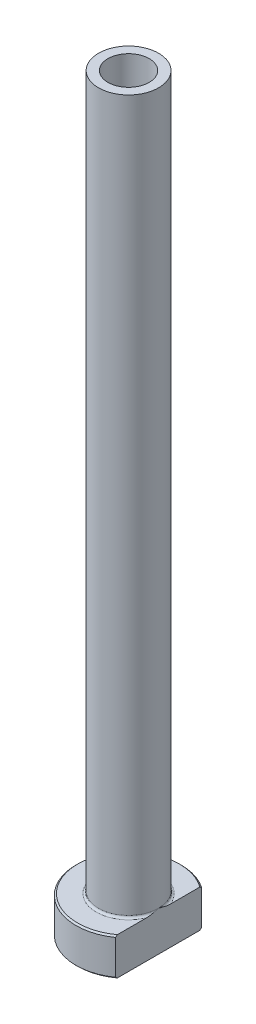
ISO-10303-21;
HEADER;
FILE_DESCRIPTION(('STEP AP214'),'2;1');
FILE_NAME('part.step','',(''),(''),'','','');
FILE_SCHEMA(('AUTOMOTIVE_DESIGN { 1 0 10303 214 1 1 1 1 }'));
ENDSEC;
DATA;
#1=APPLICATION_CONTEXT('core data for automotive mechanical design processes');
#2=APPLICATION_PROTOCOL_DEFINITION('international standard','automotive_design',2000,#1);
#3=PRODUCT_CONTEXT('',#1,'mechanical');
#4=PRODUCT('Part','Part','',(#3));
#5=PRODUCT_RELATED_PRODUCT_CATEGORY('part','',(#4));
#6=PRODUCT_DEFINITION_FORMATION('','',#4);
#7=PRODUCT_DEFINITION_CONTEXT('part definition',#1,'design');
#8=PRODUCT_DEFINITION('design','',#6,#7);
#9=PRODUCT_DEFINITION_SHAPE('','',#8);
#10=(LENGTH_UNIT() NAMED_UNIT(*) SI_UNIT(.MILLI.,.METRE.));
#11=(NAMED_UNIT(*) PLANE_ANGLE_UNIT() SI_UNIT($,.RADIAN.));
#12=(NAMED_UNIT(*) SI_UNIT($,.STERADIAN.) SOLID_ANGLE_UNIT());
#13=UNCERTAINTY_MEASURE_WITH_UNIT(LENGTH_MEASURE(1.E-05),#10,'distance_accuracy_value','');
#14=(GEOMETRIC_REPRESENTATION_CONTEXT(3) GLOBAL_UNCERTAINTY_ASSIGNED_CONTEXT((#13)) GLOBAL_UNIT_ASSIGNED_CONTEXT((#10,
#11,#12)) REPRESENTATION_CONTEXT('',''));
#15=CARTESIAN_POINT('',(0.,0.,0.));
#16=DIRECTION('',(0.,0.,1.));
#17=DIRECTION('',(1.,0.,0.));
#18=AXIS2_PLACEMENT_3D('',#15,#16,#17);
#19=CARTESIAN_POINT('',(0.,92.1876809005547,0.));
#20=DIRECTION('',(0.,1.,0.));
#21=DIRECTION('',(0.,0.,1.));
#22=AXIS2_PLACEMENT_3D('',#19,#20,#21);
#23=CYLINDRICAL_SURFACE('',#22,2.74999999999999);
#24=CARTESIAN_POINT('',(0.,100.,0.));
#25=DIRECTION('',(0.,1.,0.));
#26=DIRECTION('',(0.,0.,1.));
#27=AXIS2_PLACEMENT_3D('',#24,#25,#26);
#28=CIRCLE('',#27,2.74999999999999);
#29=CARTESIAN_POINT('',(0.,100.,2.74999999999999));
#30=VERTEX_POINT('',#29);
#31=EDGE_CURVE('E167',#30,#30,#28,.T.);
#32=ORIENTED_EDGE('',*,*,#31,.T.);
#33=EDGE_LOOP('',(#32));
#34=FACE_BOUND('',#33,.T.);
#35=CARTESIAN_POINT('',(0.,55.,0.));
#36=DIRECTION('',(0.,1.,0.));
#37=DIRECTION('',(0.,0.,1.));
#38=AXIS2_PLACEMENT_3D('',#35,#36,#37);
#39=CIRCLE('',#38,2.74999999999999);
#40=CARTESIAN_POINT('',(0.,55.,2.74999999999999));
#41=VERTEX_POINT('',#40);
#42=EDGE_CURVE('E170',#41,#41,#39,.T.);
#43=ORIENTED_EDGE('',*,*,#42,.F.);
#44=EDGE_LOOP('',(#43));
#45=FACE_BOUND('',#44,.T.);
#46=ADVANCED_FACE('F32',(#34,#45),#23,.F.);
#47=CARTESIAN_POINT('',(-2.74999999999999,100.,0.));
#48=DIRECTION('',(0.,1.,0.));
#49=DIRECTION('',(0.,0.,1.));
#50=AXIS2_PLACEMENT_3D('',#47,#48,#49);
#51=PLANE('',#50);
#52=CARTESIAN_POINT('',(0.,100.,0.));
#53=DIRECTION('',(0.,1.,0.));
#54=DIRECTION('',(0.,0.,1.));
#55=AXIS2_PLACEMENT_3D('',#52,#53,#54);
#56=CIRCLE('',#55,4.);
#57=CARTESIAN_POINT('',(0.,100.,4.));
#58=VERTEX_POINT('',#57);
#59=EDGE_CURVE('E174',#58,#58,#56,.T.);
#60=ORIENTED_EDGE('',*,*,#59,.T.);
#61=EDGE_LOOP('',(#60));
#62=FACE_BOUND('',#61,.T.);
#63=ORIENTED_EDGE('',*,*,#31,.F.);
#64=EDGE_LOOP('',(#63));
#65=FACE_BOUND('',#64,.T.);
#66=ADVANCED_FACE('F157',(#62,#65),#51,.T.);
#67=CARTESIAN_POINT('',(0.,92.1876809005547,0.));
#68=DIRECTION('',(0.,1.,0.));
#69=DIRECTION('',(0.,0.,1.));
#70=AXIS2_PLACEMENT_3D('',#67,#68,#69);
#71=CYLINDRICAL_SURFACE('',#70,4.);
#72=CARTESIAN_POINT('',(0.,5.3,0.));
#73=DIRECTION('',(0.,1.,0.));
#74=DIRECTION('',(0.,0.,1.));
#75=AXIS2_PLACEMENT_3D('',#72,#73,#74);
#76=CIRCLE('',#75,4.);
#77=CARTESIAN_POINT('',(4.,5.3,0.));
#78=VERTEX_POINT('',#77);
#79=EDGE_CURVE('E180',#78,#78,#76,.T.);
#80=ORIENTED_EDGE('',*,*,#79,.T.);
#81=EDGE_LOOP('',(#80));
#82=FACE_BOUND('',#81,.T.);
#83=ORIENTED_EDGE('',*,*,#59,.F.);
#84=EDGE_LOOP('',(#83));
#85=FACE_BOUND('',#84,.T.);
#86=ADVANCED_FACE('F162',(#82,#85),#71,.T.);
#87=CARTESIAN_POINT('',(-3.99999999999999,5.,0.));
#88=DIRECTION('',(0.,1.,0.));
#89=DIRECTION('',(0.,0.,1.));
#90=AXIS2_PLACEMENT_3D('',#87,#88,#89);
#91=PLANE('',#90);
#92=DIRECTION('',(0.,0.,1.));
#93=VECTOR('',#92,1.);
#94=CARTESIAN_POINT('',(4.,5.,0.));
#95=LINE('',#94,#93);
#96=CARTESIAN_POINT('',(4.,5.,-5.499090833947));
#97=VERTEX_POINT('',#96);
#98=CARTESIAN_POINT('',(4.,5.,-1.57797338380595));
#99=VERTEX_POINT('',#98);
#100=EDGE_CURVE('E54',#97,#99,#95,.T.);
#101=ORIENTED_EDGE('',*,*,#100,.F.);
#102=CARTESIAN_POINT('',(0.,5.,0.));
#103=DIRECTION('',(0.,1.,0.));
#104=DIRECTION('',(0.,0.,1.));
#105=AXIS2_PLACEMENT_3D('',#102,#103,#104);
#106=CIRCLE('',#105,6.79999999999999);
#107=CARTESIAN_POINT('',(3.99999999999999,5.,5.499090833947));
#108=VERTEX_POINT('',#107);
#109=EDGE_CURVE('E186',#97,#108,#106,.T.);
#110=ORIENTED_EDGE('',*,*,#109,.T.);
#111=CARTESIAN_POINT('',(4.,5.,1.57797338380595));
#112=VERTEX_POINT('',#111);
#113=EDGE_CURVE('E134',#112,#108,#95,.T.);
#114=ORIENTED_EDGE('',*,*,#113,.F.);
#115=CARTESIAN_POINT('',(0.,5.,0.));
#116=DIRECTION('',(0.,1.,0.));
#117=DIRECTION('',(0.,0.,1.));
#118=AXIS2_PLACEMENT_3D('',#115,#116,#117);
#119=CIRCLE('',#118,4.3);
#120=EDGE_CURVE('E183',#112,#99,#119,.F.);
#121=ORIENTED_EDGE('',*,*,#120,.T.);
#122=EDGE_LOOP('',(#101,#110,#114,#121));
#123=FACE_BOUND('',#122,.T.);
#124=ADVANCED_FACE('F197',(#123),#91,.T.);
#125=CARTESIAN_POINT('',(0.,92.1876809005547,0.));
#126=DIRECTION('',(0.,1.,0.));
#127=DIRECTION('',(0.,0.,1.));
#128=AXIS2_PLACEMENT_3D('',#125,#126,#127);
#129=CYLINDRICAL_SURFACE('',#128,6.99999999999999);
#130=DIRECTION('',(0.,-1.,0.));
#131=VECTOR('',#130,1.);
#132=CARTESIAN_POINT('',(3.99999999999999,100.,5.74456264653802));
#133=LINE('',#132,#131);
#134=CARTESIAN_POINT('',(3.99999999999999,4.8,5.74456264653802));
#135=VERTEX_POINT('',#134);
#136=CARTESIAN_POINT('',(3.99999999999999,0.199999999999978,5.74456264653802));
#137=VERTEX_POINT('',#136);
#138=EDGE_CURVE('E82',#135,#137,#133,.T.);
#139=ORIENTED_EDGE('',*,*,#138,.F.);
#140=CARTESIAN_POINT('',(0.,4.8,0.));
#141=DIRECTION('',(0.,1.,0.));
#142=DIRECTION('',(0.,0.,1.));
#143=AXIS2_PLACEMENT_3D('',#140,#141,#142);
#144=CIRCLE('',#143,6.99999999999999);
#145=CARTESIAN_POINT('',(4.,4.8,-5.74456264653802));
#146=VERTEX_POINT('',#145);
#147=EDGE_CURVE('E95',#135,#146,#144,.F.);
#148=ORIENTED_EDGE('',*,*,#147,.T.);
#149=DIRECTION('',(0.,-1.,0.));
#150=VECTOR('',#149,1.);
#151=CARTESIAN_POINT('',(4.,100.,-5.74456264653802));
#152=LINE('',#151,#150);
#153=CARTESIAN_POINT('',(4.,0.199999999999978,-5.74456264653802));
#154=VERTEX_POINT('',#153);
#155=EDGE_CURVE('E192',#146,#154,#152,.T.);
#156=ORIENTED_EDGE('',*,*,#155,.T.);
#157=CARTESIAN_POINT('',(0.,0.199999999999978,0.));
#158=DIRECTION('',(0.,-1.,0.));
#159=DIRECTION('',(0.,0.,-1.));
#160=AXIS2_PLACEMENT_3D('',#157,#158,#159);
#161=CIRCLE('',#160,6.99999999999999);
#162=EDGE_CURVE('E98',#154,#137,#161,.F.);
#163=ORIENTED_EDGE('',*,*,#162,.T.);
#164=EDGE_LOOP('',(#139,#148,#156,#163));
#165=FACE_BOUND('',#164,.T.);
#166=ADVANCED_FACE('F190',(#165),#129,.T.);
#167=CARTESIAN_POINT('',(-6.99999999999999,0.,0.));
#168=DIRECTION('',(0.,-1.,0.));
#169=DIRECTION('',(0.,0.,-1.));
#170=AXIS2_PLACEMENT_3D('',#167,#168,#169);
#171=PLANE('',#170);
#172=CARTESIAN_POINT('',(0.,0.,0.));
#173=DIRECTION('',(0.,-1.,0.));
#174=DIRECTION('',(0.,0.,-1.));
#175=AXIS2_PLACEMENT_3D('',#172,#173,#174);
#176=CIRCLE('',#175,3.49999999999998);
#177=CARTESIAN_POINT('',(0.,0.,-3.49999999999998));
#178=VERTEX_POINT('',#177);
#179=EDGE_CURVE('E40',#178,#178,#176,.F.);
#180=ORIENTED_EDGE('',*,*,#179,.T.);
#181=EDGE_LOOP('',(#180));
#182=FACE_BOUND('',#181,.T.);
#183=DIRECTION('',(0.,0.,-1.));
#184=VECTOR('',#183,1.);
#185=CARTESIAN_POINT('',(3.99999999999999,0.,5.74456264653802));
#186=LINE('',#185,#184);
#187=CARTESIAN_POINT('',(3.99999999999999,0.,5.49909083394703));
#188=VERTEX_POINT('',#187);
#189=CARTESIAN_POINT('',(4.,0.,-5.49909083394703));
#190=VERTEX_POINT('',#189);
#191=EDGE_CURVE('E47',#188,#190,#186,.T.);
#192=ORIENTED_EDGE('',*,*,#191,.F.);
#193=CARTESIAN_POINT('',(0.,0.,0.));
#194=DIRECTION('',(0.,-1.,0.));
#195=DIRECTION('',(0.,0.,-1.));
#196=AXIS2_PLACEMENT_3D('',#193,#194,#195);
#197=CIRCLE('',#196,6.80000000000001);
#198=EDGE_CURVE('E92',#188,#190,#197,.T.);
#199=ORIENTED_EDGE('',*,*,#198,.T.);
#200=EDGE_LOOP('',(#192,#199));
#201=FACE_BOUND('',#200,.T.);
#202=ADVANCED_FACE('F91',(#182,#201),#171,.T.);
#203=CARTESIAN_POINT('',(0.,92.1876809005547,0.));
#204=DIRECTION('',(0.,1.,0.));
#205=DIRECTION('',(0.,0.,1.));
#206=AXIS2_PLACEMENT_3D('',#203,#204,#205);
#207=CYLINDRICAL_SURFACE('',#206,2.99999999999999);
#208=CARTESIAN_POINT('',(0.,0.499999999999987,0.));
#209=DIRECTION('',(0.,-1.,0.));
#210=DIRECTION('',(0.,0.,-1.));
#211=AXIS2_PLACEMENT_3D('',#208,#209,#210);
#212=CIRCLE('',#211,2.99999999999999);
#213=CARTESIAN_POINT('',(0.,0.499999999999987,-2.99999999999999));
#214=VERTEX_POINT('',#213);
#215=EDGE_CURVE('E11',#214,#214,#212,.T.);
#216=ORIENTED_EDGE('',*,*,#215,.T.);
#217=EDGE_LOOP('',(#216));
#218=FACE_BOUND('',#217,.T.);
#219=CARTESIAN_POINT('',(0.,43.,0.));
#220=DIRECTION('',(0.,1.,0.));
#221=DIRECTION('',(0.,0.,1.));
#222=AXIS2_PLACEMENT_3D('',#219,#220,#221);
#223=CIRCLE('',#222,3.);
#224=CARTESIAN_POINT('',(0.,43.,3.));
#225=VERTEX_POINT('',#224);
#226=EDGE_CURVE('E172',#225,#225,#223,.T.);
#227=ORIENTED_EDGE('',*,*,#226,.T.);
#228=EDGE_LOOP('',(#227));
#229=FACE_BOUND('',#228,.T.);
#230=ADVANCED_FACE('F215',(#218,#229),#207,.F.);
#231=CARTESIAN_POINT('',(0.,43.,0.));
#232=DIRECTION('',(0.,-1.,0.));
#233=DIRECTION('',(0.,0.,-1.));
#234=AXIS2_PLACEMENT_3D('',#231,#232,#233);
#235=CONICAL_SURFACE('',#234,3.,0.0208303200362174);
#236=ORIENTED_EDGE('',*,*,#42,.T.);
#237=EDGE_LOOP('',(#236));
#238=FACE_BOUND('',#237,.T.);
#239=ORIENTED_EDGE('',*,*,#226,.F.);
#240=EDGE_LOOP('',(#239));
#241=FACE_BOUND('',#240,.T.);
#242=ADVANCED_FACE('F111',(#238,#241),#235,.F.);
#243=CARTESIAN_POINT('',(0.,5.3,0.));
#244=DIRECTION('',(0.,1.,0.));
#245=DIRECTION('',(0.,0.,1.));
#246=AXIS2_PLACEMENT_3D('',#243,#244,#245);
#247=TOROIDAL_SURFACE('',#246,4.3,0.3);
#248=ORIENTED_EDGE('',*,*,#120,.F.);
#249=CARTESIAN_POINT('',(4.,5.3,0.));
#250=CARTESIAN_POINT('',(4.,5.30000062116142,-1.06250722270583E-10));
#251=CARTESIAN_POINT('',(4.,5.30000124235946,2.17726018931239E-07));
#252=CARTESIAN_POINT('',(4.,5.30000240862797,8.3614089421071E-07));
#253=CARTESIAN_POINT('',(4.,5.30000294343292,1.25011668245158E-06));
#254=CARTESIAN_POINT('',(4.,5.30000404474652,2.2395931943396E-06));
#255=CARTESIAN_POINT('',(4.,5.30000459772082,2.83084440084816E-06));
#256=CARTESIAN_POINT('',(4.,5.30000559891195,4.06516578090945E-06));
#257=CARTESIAN_POINT('',(4.,5.30000604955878,4.70640059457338E-06));
#258=CARTESIAN_POINT('',(4.,5.30000769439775,7.15677166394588E-06));
#259=CARTESIAN_POINT('',(4.,5.30000879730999,9.02995921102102E-06));
#260=CARTESIAN_POINT('',(4.,5.30001063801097,1.27664881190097E-05));
#261=CARTESIAN_POINT('',(4.,5.30001139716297,1.46197801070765E-05));
#262=CARTESIAN_POINT('',(4.,5.30001453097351,2.23679212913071E-05));
#263=CARTESIAN_POINT('',(4.,5.30001683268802,2.82968736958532E-05));
#264=CARTESIAN_POINT('',(4.,5.30002027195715,3.95668715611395E-05));
#265=CARTESIAN_POINT('',(4.,5.30002152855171,4.48715448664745E-05));
#266=CARTESIAN_POINT('',(4.,5.30003060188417,8.40118178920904E-05));
#267=CARTESIAN_POINT('',(4.,5.30003739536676,0.000118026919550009));
#268=CARTESIAN_POINT('',(4.,5.30006713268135,0.000252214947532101));
#269=CARTESIAN_POINT('',(4.,5.30009559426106,0.000351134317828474));
#270=CARTESIAN_POINT('',(4.,5.3002062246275,0.00074247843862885));
#271=CARTESIAN_POINT('',(4.,5.30028475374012,0.00103561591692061));
#272=CARTESIAN_POINT('',(4.,5.30059889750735,0.0021992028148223));
#273=CARTESIAN_POINT('',(4.,5.30083905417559,0.00306873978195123));
#274=CARTESIAN_POINT('',(4.,5.3018368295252,0.00669141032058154));
#275=CARTESIAN_POINT('',(4.,5.30258877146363,0.00944568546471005));
#276=CARTESIAN_POINT('',(4.,5.31066890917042,0.039029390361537));
#277=CARTESIAN_POINT('',(4.,5.31802631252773,0.0658531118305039));
#278=CARTESIAN_POINT('',(4.,5.33239676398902,0.118441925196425));
#279=CARTESIAN_POINT('',(4.,5.33941183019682,0.144206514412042));
#280=CARTESIAN_POINT('',(4.,5.35427366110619,0.199017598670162));
#281=CARTESIAN_POINT('',(4.,5.36211313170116,0.228066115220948));
#282=CARTESIAN_POINT('',(4.,5.37776349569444,0.286511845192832));
#283=CARTESIAN_POINT('',(4.,5.38557313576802,0.31590939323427));
#284=CARTESIAN_POINT('',(4.,5.40425662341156,0.386994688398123));
#285=CARTESIAN_POINT('',(4.,5.41505237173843,0.428703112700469));
#286=CARTESIAN_POINT('',(4.,5.43592310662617,0.511098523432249));
#287=CARTESIAN_POINT('',(4.,5.44600969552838,0.551782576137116));
#288=CARTESIAN_POINT('',(4.,5.4785098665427,0.686599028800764));
#289=CARTESIAN_POINT('',(4.,5.4997837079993,0.781011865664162));
#290=CARTESIAN_POINT('',(4.,5.53807543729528,0.971847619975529));
#291=CARTESIAN_POINT('',(4.,5.55504273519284,1.06828120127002));
#292=CARTESIAN_POINT('',(4.,5.57582405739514,1.21752725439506));
#293=CARTESIAN_POINT('',(4.,5.58209796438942,1.26999379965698));
#294=CARTESIAN_POINT('',(4.,5.59210686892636,1.37516324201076));
#295=CARTESIAN_POINT('',(4.,5.59584265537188,1.42786606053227));
#296=CARTESIAN_POINT('',(4.,5.60010438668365,1.53310673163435));
#297=CARTESIAN_POINT('',(4.,5.6006487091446,1.5856437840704));
#298=CARTESIAN_POINT('',(4.,5.59767158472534,1.69058605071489));
#299=CARTESIAN_POINT('',(4.,5.59415502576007,1.74299134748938));
#300=CARTESIAN_POINT('',(4.,5.58503062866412,1.81903290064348));
#301=CARTESIAN_POINT('',(4.,5.58157617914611,1.84292934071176));
#302=CARTESIAN_POINT('',(4.,5.57329952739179,1.89051061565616));
#303=CARTESIAN_POINT('',(4.,5.56847619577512,1.91419525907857));
#304=CARTESIAN_POINT('',(4.,5.55726644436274,1.96092888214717));
#305=CARTESIAN_POINT('',(4.,5.55089740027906,1.98398195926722));
#306=CARTESIAN_POINT('',(4.,5.53623434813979,2.02945550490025));
#307=CARTESIAN_POINT('',(4.,5.52794253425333,2.05187666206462));
#308=CARTESIAN_POINT('',(4.,5.50887098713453,2.09590631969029));
#309=CARTESIAN_POINT('',(4.,5.49806837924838,2.11750508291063));
#310=CARTESIAN_POINT('',(4.,5.47333401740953,2.15885583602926));
#311=CARTESIAN_POINT('',(4.,5.45941272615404,2.17861369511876));
#312=CARTESIAN_POINT('',(4.,5.43588221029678,2.20522942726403));
#313=CARTESIAN_POINT('',(4.,5.42781139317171,2.2134404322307));
#314=CARTESIAN_POINT('',(4.,5.41065114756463,2.2287514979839));
#315=CARTESIAN_POINT('',(4.,5.40156129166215,2.23585108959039));
#316=CARTESIAN_POINT('',(4.,5.38220524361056,2.2485969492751));
#317=CARTESIAN_POINT('',(4.,5.37192420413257,2.25422119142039));
#318=CARTESIAN_POINT('',(4.,5.35045072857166,2.2633106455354));
#319=CARTESIAN_POINT('',(4.,5.33926122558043,2.26678251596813));
#320=CARTESIAN_POINT('',(4.,5.31952044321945,2.27051268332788));
#321=CARTESIAN_POINT('',(4.,5.3110845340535,2.27139016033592));
#322=CARTESIAN_POINT('',(4.,5.29418624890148,2.2716896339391));
#323=CARTESIAN_POINT('',(4.,5.28572387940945,2.27111196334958));
#324=CARTESIAN_POINT('',(4.,5.26904138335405,2.26855580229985));
#325=CARTESIAN_POINT('',(4.,5.26082066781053,2.26658107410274));
#326=CARTESIAN_POINT('',(4.,5.24478214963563,2.26139496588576));
#327=CARTESIAN_POINT('',(4.,5.23696461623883,2.25818277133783));
#328=CARTESIAN_POINT('',(4.,5.21851235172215,2.24908332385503));
#329=CARTESIAN_POINT('',(4.,5.20815219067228,2.24264095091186));
#330=CARTESIAN_POINT('',(4.,5.18857975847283,2.22819957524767));
#331=CARTESIAN_POINT('',(4.,5.17937061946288,2.2201964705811));
#332=CARTESIAN_POINT('',(4.,5.15665383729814,2.19777756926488));
#333=CARTESIAN_POINT('',(4.,5.14403484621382,2.18246908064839));
#334=CARTESIAN_POINT('',(4.,5.12118369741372,2.15020843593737));
#335=CARTESIAN_POINT('',(4.,5.11095480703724,2.13325407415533));
#336=CARTESIAN_POINT('',(4.,5.09273574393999,2.09892324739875));
#337=CARTESIAN_POINT('',(4.,5.08468212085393,2.08157988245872));
#338=CARTESIAN_POINT('',(4.,5.07005901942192,2.04627072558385));
#339=CARTESIAN_POINT('',(4.,5.06349101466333,2.02830433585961));
#340=CARTESIAN_POINT('',(4.,5.04555485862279,1.97350761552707));
#341=CARTESIAN_POINT('',(4.,5.03608974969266,1.93605770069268));
#342=CARTESIAN_POINT('',(4.,5.01780569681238,1.84529235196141));
#343=CARTESIAN_POINT('',(4.,5.01077018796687,1.79164082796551));
#344=CARTESIAN_POINT('',(4.,5.00182846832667,1.68379947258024));
#345=CARTESIAN_POINT('',(4.,4.99993887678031,1.62960846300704));
#346=CARTESIAN_POINT('',(4.,5.00006129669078,1.52361204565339));
#347=CARTESIAN_POINT('',(4.,5.0019069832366,1.47180551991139));
#348=CARTESIAN_POINT('',(4.,5.0084124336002,1.36835357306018));
#349=CARTESIAN_POINT('',(4.,5.01307376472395,1.31670825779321));
#350=CARTESIAN_POINT('',(4.,5.02905484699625,1.17431887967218));
#351=CARTESIAN_POINT('',(4.,5.04274090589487,1.08384207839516));
#352=CARTESIAN_POINT('',(4.,5.06701714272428,0.947757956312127));
#353=CARTESIAN_POINT('',(4.,5.07585573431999,0.901814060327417));
#354=CARTESIAN_POINT('',(4.,5.09458665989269,0.810008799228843));
#355=CARTESIAN_POINT('',(4.,5.1044818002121,0.764148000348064));
#356=CARTESIAN_POINT('',(4.,5.12892434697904,0.655631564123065));
#357=CARTESIAN_POINT('',(4.,5.14383556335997,0.593058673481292));
#358=CARTESIAN_POINT('',(4.,5.17458762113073,0.468885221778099));
#359=CARTESIAN_POINT('',(4.,5.19041623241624,0.407281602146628));
#360=CARTESIAN_POINT('',(4.,5.22090834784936,0.29123270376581));
#361=CARTESIAN_POINT('',(4.,5.23550024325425,0.236768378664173));
#362=CARTESIAN_POINT('',(4.,5.26562550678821,0.125604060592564));
#363=CARTESIAN_POINT('',(4.,5.28117250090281,0.0689076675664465));
#364=CARTESIAN_POINT('',(4.,5.29741226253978,0.0094415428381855));
#365=CARTESIAN_POINT('',(4.,5.29816540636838,0.00668315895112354));
#366=CARTESIAN_POINT('',(4.,5.29916346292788,0.00305954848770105));
#367=CARTESIAN_POINT('',(4.,5.29940273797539,0.00219318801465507));
#368=CARTESIAN_POINT('',(4.,5.2997158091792,0.00103357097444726));
#369=CARTESIAN_POINT('',(4.,5.29979412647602,0.00074122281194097));
#370=CARTESIAN_POINT('',(4.,5.29990450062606,0.000350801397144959));
#371=CARTESIAN_POINT('',(4.,5.29993292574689,0.000252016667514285));
#372=CARTESIAN_POINT('',(4.,5.29996263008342,0.000117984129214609));
#373=CARTESIAN_POINT('',(4.,5.29996941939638,8.39881862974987E-05));
#374=CARTESIAN_POINT('',(4.,5.29997848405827,4.48673992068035E-05));
#375=CARTESIAN_POINT('',(4.,5.29997973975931,3.95638164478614E-05));
#376=CARTESIAN_POINT('',(4.,5.29998317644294,2.8296031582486E-05));
#377=CARTESIAN_POINT('',(4.,5.2999854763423,2.23681438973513E-05));
#378=CARTESIAN_POINT('',(4.,5.29998860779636,1.46210990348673E-05));
#379=CARTESIAN_POINT('',(4.,5.29998936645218,1.27678887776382E-05));
#380=CARTESIAN_POINT('',(4.,5.29999120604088,9.03143944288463E-06));
#381=CARTESIAN_POINT('',(4.,5.29999230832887,7.15824000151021E-06));
#382=CARTESIAN_POINT('',(4.,5.29999395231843,4.70775467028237E-06));
#383=CARTESIAN_POINT('',(4.,5.29999440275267,4.06646329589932E-06));
#384=CARTESIAN_POINT('',(4.,5.29999540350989,2.83199042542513E-06));
#385=CARTESIAN_POINT('',(4.,5.29999595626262,2.24064306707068E-06));
#386=CARTESIAN_POINT('',(4.,5.29999705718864,1.25093947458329E-06));
#387=CARTESIAN_POINT('',(4.,5.2999975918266,8.36840866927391E-07));
#388=CARTESIAN_POINT('',(4.,5.29999875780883,2.18117657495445E-07));
#389=CARTESIAN_POINT('',(4.,5.29999937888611,1.06243800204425E-10));
#390=CARTESIAN_POINT('',(4.,5.3,0.));
#391=B_SPLINE_CURVE_WITH_KNOTS('',3,(#249,#250,#251,#252,#253,#254,#255,#256,#257,#258,#259,
#260,#261,#262,#263,#264,#265,#266,#267,#268,#269,#270,#271,#272,#273,#274,#275,#276,#277,#278,
#279,#280,#281,#282,#283,#284,#285,#286,#287,#288,#289,#290,#291,#292,#293,#294,#295,#296,#297,
#298,#299,#300,#301,#302,#303,#304,#305,#306,#307,#308,#309,#310,#311,#312,#313,#314,#315,#316,
#317,#318,#319,#320,#321,#322,#323,#324,#325,#326,#327,#328,#329,#330,#331,#332,#333,#334,#335,
#336,#337,#338,#339,#340,#341,#342,#343,#344,#345,#346,#347,#348,#349,#350,#351,#352,#353,#354,
#355,#356,#357,#358,#359,#360,#361,#362,#363,#364,#365,#366,#367,#368,#369,#370,#371,#372,#373,
#374,#375,#376,#377,#378,#379,#380,#381,#382,#383,#384,#385,#386,#387,#388,#389,#390),
.UNSPECIFIED.,.T.,.F.,(4,2,2,2,2,2,2,2,2,2,2,2,2,2,2,2,2,2,2,2,2,2,2,2,2,2,2,2,2,2,2,2,2,2,2,2,
2,2,2,2,2,2,2,2,2,2,2,2,2,2,2,2,2,2,2,2,2,2,2,2,2,2,2,2,2,2,2,2,2,2,4),(0.,1.87484528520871E-06,
3.90180232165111E-06,6.31684114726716E-06,8.6665232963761E-06,1.51627596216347E-05,
2.11657986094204E-05,4.02090827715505E-05,5.65429538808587E-05,0.00016062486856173,
0.000469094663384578,0.001379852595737,0.00408571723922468,0.0126514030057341,
0.0960918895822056,0.176200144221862,0.266463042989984,0.357714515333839,0.486961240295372,
0.612707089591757,0.902988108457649,1.19653589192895,1.35501075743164,1.51343634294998,
1.67094875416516,1.82827177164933,1.90067591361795,1.97313996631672,2.04482437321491,
2.11642737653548,2.18871023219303,2.26075412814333,2.29521947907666,2.32969934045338,
2.36466792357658,2.39952778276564,2.42485422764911,2.45017488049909,2.47542760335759,
2.50069697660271,2.53708899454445,2.57357798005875,2.63276032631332,2.6920231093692,
2.749303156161,2.80663977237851,2.92223125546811,3.08420752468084,3.24670629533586,
3.40212850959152,3.55763731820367,3.83192962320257,3.97228382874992,4.11302057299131,
4.30598130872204,4.49678885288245,4.66594443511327,4.84230602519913,4.85088453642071,
4.8535805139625,4.8544888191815,4.85479687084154,4.85490089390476,4.85491722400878,
4.85493626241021,4.85494226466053,4.85494875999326,4.85495110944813,4.85495352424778,
4.85495555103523,4.85495742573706),.UNSPECIFIED.);
#392=EDGE_CURVE('E126',#112,#78,#391,.T.);
#393=ORIENTED_EDGE('',*,*,#392,.T.);
#394=ORIENTED_EDGE('',*,*,#79,.F.);
#395=CARTESIAN_POINT('',(4.,5.3,0.));
#396=CARTESIAN_POINT('',(4.,5.29999937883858,1.06251755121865E-10));
#397=CARTESIAN_POINT('',(4.,5.29999875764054,-2.17726017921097E-07));
#398=CARTESIAN_POINT('',(4.,5.29999759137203,-8.36140893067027E-07));
#399=CARTESIAN_POINT('',(4.,5.29999705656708,-1.25011668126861E-06));
#400=CARTESIAN_POINT('',(4.,5.29999595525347,-2.23959319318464E-06));
#401=CARTESIAN_POINT('',(4.,5.29999540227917,-2.83084439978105E-06));
#402=CARTESIAN_POINT('',(4.,5.29999440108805,-4.06516577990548E-06));
#403=CARTESIAN_POINT('',(4.,5.29999395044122,-4.706400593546E-06));
#404=CARTESIAN_POINT('',(4.,5.29999230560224,-7.15677166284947E-06));
#405=CARTESIAN_POINT('',(3.99999999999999,5.29999120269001,-9.02995920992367E-06));
#406=CARTESIAN_POINT('',(3.99999999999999,5.29998936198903,-1.2766488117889E-05));
#407=CARTESIAN_POINT('',(4.,5.29998860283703,-1.46197801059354E-05));
#408=CARTESIAN_POINT('',(4.,5.29998546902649,-2.23679212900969E-05));
#409=CARTESIAN_POINT('',(4.,5.29998316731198,-2.82968736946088E-05));
#410=CARTESIAN_POINT('',(4.,5.29997972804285,-3.95668715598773E-05));
#411=CARTESIAN_POINT('',(4.,5.29997847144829,-4.48715448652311E-05));
#412=CARTESIAN_POINT('',(4.,5.29996939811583,-8.40118178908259E-05));
#413=CARTESIAN_POINT('',(4.,5.29996260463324,-0.000118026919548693));
#414=CARTESIAN_POINT('',(3.99999999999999,5.29993286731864,-0.000252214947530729));
#415=CARTESIAN_POINT('',(4.,5.29990440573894,-0.000351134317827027));
#416=CARTESIAN_POINT('',(4.,5.2997937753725,-0.000742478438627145));
#417=CARTESIAN_POINT('',(4.,5.29971524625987,-0.00103561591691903));
#418=CARTESIAN_POINT('',(3.99999999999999,5.29940110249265,-0.00219920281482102));
#419=CARTESIAN_POINT('',(3.99999999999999,5.29916094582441,-0.00306873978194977));
#420=CARTESIAN_POINT('',(4.,5.2981631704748,-0.00669141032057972));
#421=CARTESIAN_POINT('',(4.,5.29741122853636,-0.0094456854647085));
#422=CARTESIAN_POINT('',(3.99999999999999,5.28933109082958,-0.039029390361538));
#423=CARTESIAN_POINT('',(3.99999999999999,5.28197368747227,-0.0658531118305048));
#424=CARTESIAN_POINT('',(4.,5.26760323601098,-0.118441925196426));
#425=CARTESIAN_POINT('',(4.,5.26058816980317,-0.144206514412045));
#426=CARTESIAN_POINT('',(3.99999999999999,5.24572633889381,-0.199017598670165));
#427=CARTESIAN_POINT('',(4.,5.23788686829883,-0.22806611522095));
#428=CARTESIAN_POINT('',(4.,5.22223650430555,-0.286511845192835));
#429=CARTESIAN_POINT('',(4.,5.21442686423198,-0.315909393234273));
#430=CARTESIAN_POINT('',(4.,5.19574337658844,-0.386994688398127));
#431=CARTESIAN_POINT('',(4.,5.18494762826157,-0.428703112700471));
#432=CARTESIAN_POINT('',(4.,5.16407689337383,-0.511098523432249));
#433=CARTESIAN_POINT('',(4.,5.15399030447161,-0.551782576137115));
#434=CARTESIAN_POINT('',(4.,5.12149013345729,-0.686599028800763));
#435=CARTESIAN_POINT('',(4.,5.1002162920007,-0.781011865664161));
#436=CARTESIAN_POINT('',(4.,5.06192456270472,-0.971847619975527));
#437=CARTESIAN_POINT('',(4.,5.04495726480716,-1.06828120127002));
#438=CARTESIAN_POINT('',(4.,5.02417594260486,-1.21752725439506));
#439=CARTESIAN_POINT('',(4.,5.01790203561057,-1.26999379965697));
#440=CARTESIAN_POINT('',(4.,5.00789313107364,-1.37516324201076));
#441=CARTESIAN_POINT('',(4.,5.00415734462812,-1.42786606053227));
#442=CARTESIAN_POINT('',(4.,4.99989561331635,-1.53310673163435));
#443=CARTESIAN_POINT('',(4.,4.9993512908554,-1.5856437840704));
#444=CARTESIAN_POINT('',(4.,5.00232841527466,-1.69058605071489));
#445=CARTESIAN_POINT('',(4.,5.00584497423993,-1.74299134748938));
#446=CARTESIAN_POINT('',(4.,5.01496937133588,-1.81903290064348));
#447=CARTESIAN_POINT('',(4.,5.01842382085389,-1.84292934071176));
#448=CARTESIAN_POINT('',(4.,5.02670047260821,-1.89051061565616));
#449=CARTESIAN_POINT('',(4.,5.03152380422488,-1.91419525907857));
#450=CARTESIAN_POINT('',(4.,5.04273355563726,-1.96092888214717));
#451=CARTESIAN_POINT('',(4.,5.04910259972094,-1.98398195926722));
#452=CARTESIAN_POINT('',(4.,5.0637656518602,-2.02945550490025));
#453=CARTESIAN_POINT('',(4.,5.07205746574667,-2.05187666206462));
#454=CARTESIAN_POINT('',(4.,5.09112901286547,-2.09590631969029));
#455=CARTESIAN_POINT('',(4.,5.10193162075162,-2.11750508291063));
#456=CARTESIAN_POINT('',(4.,5.12666598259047,-2.15885583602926));
#457=CARTESIAN_POINT('',(4.,5.14058727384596,-2.17861369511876));
#458=CARTESIAN_POINT('',(4.,5.16411778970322,-2.20522942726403));
#459=CARTESIAN_POINT('',(4.,5.17218860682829,-2.2134404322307));
#460=CARTESIAN_POINT('',(4.,5.18934885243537,-2.2287514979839));
#461=CARTESIAN_POINT('',(4.,5.19843870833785,-2.23585108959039));
#462=CARTESIAN_POINT('',(4.,5.21779475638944,-2.2485969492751));
#463=CARTESIAN_POINT('',(4.,5.22807579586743,-2.25422119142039));
#464=CARTESIAN_POINT('',(4.,5.24954927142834,-2.2633106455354));
#465=CARTESIAN_POINT('',(4.,5.26073877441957,-2.26678251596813));
#466=CARTESIAN_POINT('',(4.,5.28047955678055,-2.27051268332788));
#467=CARTESIAN_POINT('',(4.,5.2889154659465,-2.27139016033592));
#468=CARTESIAN_POINT('',(4.,5.30581375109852,-2.2716896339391));
#469=CARTESIAN_POINT('',(4.,5.31427612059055,-2.27111196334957));
#470=CARTESIAN_POINT('',(4.,5.33095861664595,-2.26855580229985));
#471=CARTESIAN_POINT('',(4.,5.33917933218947,-2.26658107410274));
#472=CARTESIAN_POINT('',(4.,5.35521785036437,-2.26139496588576));
#473=CARTESIAN_POINT('',(4.,5.36303538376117,-2.25818277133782));
#474=CARTESIAN_POINT('',(4.,5.38148764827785,-2.24908332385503));
#475=CARTESIAN_POINT('',(4.,5.39184780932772,-2.24264095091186));
#476=CARTESIAN_POINT('',(4.,5.41142024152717,-2.22819957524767));
#477=CARTESIAN_POINT('',(4.,5.42062938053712,-2.2201964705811));
#478=CARTESIAN_POINT('',(4.,5.44334616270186,-2.19777756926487));
#479=CARTESIAN_POINT('',(4.,5.45596515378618,-2.18246908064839));
#480=CARTESIAN_POINT('',(4.,5.47881630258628,-2.15020843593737));
#481=CARTESIAN_POINT('',(4.,5.48904519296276,-2.13325407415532));
#482=CARTESIAN_POINT('',(4.,5.50726425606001,-2.09892324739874));
#483=CARTESIAN_POINT('',(4.,5.51531787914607,-2.08157988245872));
#484=CARTESIAN_POINT('',(4.,5.52994098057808,-2.04627072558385));
#485=CARTESIAN_POINT('',(4.,5.53650898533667,-2.02830433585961));
#486=CARTESIAN_POINT('',(4.,5.55444514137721,-1.97350761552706));
#487=CARTESIAN_POINT('',(4.,5.56391025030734,-1.93605770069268));
#488=CARTESIAN_POINT('',(4.,5.58219430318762,-1.8452923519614));
#489=CARTESIAN_POINT('',(4.,5.58922981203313,-1.79164082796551));
#490=CARTESIAN_POINT('',(4.,5.59817153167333,-1.68379947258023));
#491=CARTESIAN_POINT('',(4.,5.60006112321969,-1.62960846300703));
#492=CARTESIAN_POINT('',(4.,5.59993870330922,-1.52361204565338));
#493=CARTESIAN_POINT('',(4.,5.5980930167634,-1.47180551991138));
#494=CARTESIAN_POINT('',(4.,5.5915875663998,-1.36835357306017));
#495=CARTESIAN_POINT('',(4.,5.58692623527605,-1.31670825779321));
#496=CARTESIAN_POINT('',(4.,5.57094515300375,-1.17431887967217));
#497=CARTESIAN_POINT('',(4.,5.55725909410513,-1.08384207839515));
#498=CARTESIAN_POINT('',(4.,5.53298285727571,-0.947757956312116));
#499=CARTESIAN_POINT('',(4.,5.52414426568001,-0.901814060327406));
#500=CARTESIAN_POINT('',(4.,5.5054133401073,-0.810008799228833));
#501=CARTESIAN_POINT('',(4.,5.4955181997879,-0.764148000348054));
#502=CARTESIAN_POINT('',(4.,5.47107565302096,-0.655631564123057));
#503=CARTESIAN_POINT('',(4.,5.45616443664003,-0.593058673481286));
#504=CARTESIAN_POINT('',(4.,5.42541237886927,-0.468885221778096));
#505=CARTESIAN_POINT('',(3.99999999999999,5.40958376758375,-0.407281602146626));
#506=CARTESIAN_POINT('',(4.,5.37909165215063,-0.291232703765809));
#507=CARTESIAN_POINT('',(4.,5.36449975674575,-0.236768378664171));
#508=CARTESIAN_POINT('',(3.99999999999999,5.33437449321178,-0.125604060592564));
#509=CARTESIAN_POINT('',(3.99999999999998,5.31882749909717,-0.0689076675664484));
#510=CARTESIAN_POINT('',(4.,5.30258773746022,-0.00944154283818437));
#511=CARTESIAN_POINT('',(4.,5.30183459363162,-0.00668315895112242));
#512=CARTESIAN_POINT('',(3.99999999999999,5.30083653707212,-0.00305954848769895));
#513=CARTESIAN_POINT('',(3.99999999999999,5.30059726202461,-0.00219318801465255));
#514=CARTESIAN_POINT('',(4.,5.30028419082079,-0.00103357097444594));
#515=CARTESIAN_POINT('',(4.,5.30020587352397,-0.000741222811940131));
#516=CARTESIAN_POINT('',(4.,5.30009549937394,-0.000350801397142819));
#517=CARTESIAN_POINT('',(3.99999999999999,5.30006707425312,-0.000252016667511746));
#518=CARTESIAN_POINT('',(4.,5.30003736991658,-0.000117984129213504));
#519=CARTESIAN_POINT('',(4.,5.30003058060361,-8.39881862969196E-05));
#520=CARTESIAN_POINT('',(4.,5.30002151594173,-4.48673992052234E-05));
#521=CARTESIAN_POINT('',(4.,5.30002026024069,-3.95638164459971E-05));
#522=CARTESIAN_POINT('',(4.,5.30001682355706,-2.82960315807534E-05));
#523=CARTESIAN_POINT('',(4.,5.3000145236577,-2.23681438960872E-05));
#524=CARTESIAN_POINT('',(4.,5.30001139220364,-1.46210990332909E-05));
#525=CARTESIAN_POINT('',(3.99999999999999,5.30001063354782,-1.27678887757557E-05));
#526=CARTESIAN_POINT('',(3.99999999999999,5.30000879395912,-9.03143944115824E-06));
#527=CARTESIAN_POINT('',(4.,5.30000769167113,-7.15824000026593E-06));
#528=CARTESIAN_POINT('',(4.,5.30000604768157,-4.70775466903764E-06));
#529=CARTESIAN_POINT('',(4.,5.30000559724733,-4.0664632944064E-06));
#530=CARTESIAN_POINT('',(4.,5.30000459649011,-2.83199042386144E-06));
#531=CARTESIAN_POINT('',(4.,5.30000404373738,-2.24064306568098E-06));
#532=CARTESIAN_POINT('',(4.,5.30000294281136,-1.25093947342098E-06));
#533=CARTESIAN_POINT('',(4.,5.30000240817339,-8.36840865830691E-07));
#534=CARTESIAN_POINT('',(4.,5.30000124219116,-2.18117656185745E-07));
#535=CARTESIAN_POINT('',(4.,5.30000062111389,-1.06242417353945E-10));
#536=CARTESIAN_POINT('',(4.,5.3,0.));
#537=B_SPLINE_CURVE_WITH_KNOTS('',3,(#395,#396,#397,#398,#399,#400,#401,#402,#403,#404,#405,
#406,#407,#408,#409,#410,#411,#412,#413,#414,#415,#416,#417,#418,#419,#420,#421,#422,#423,#424,
#425,#426,#427,#428,#429,#430,#431,#432,#433,#434,#435,#436,#437,#438,#439,#440,#441,#442,#443,
#444,#445,#446,#447,#448,#449,#450,#451,#452,#453,#454,#455,#456,#457,#458,#459,#460,#461,#462,
#463,#464,#465,#466,#467,#468,#469,#470,#471,#472,#473,#474,#475,#476,#477,#478,#479,#480,#481,
#482,#483,#484,#485,#486,#487,#488,#489,#490,#491,#492,#493,#494,#495,#496,#497,#498,#499,#500,
#501,#502,#503,#504,#505,#506,#507,#508,#509,#510,#511,#512,#513,#514,#515,#516,#517,#518,#519,
#520,#521,#522,#523,#524,#525,#526,#527,#528,#529,#530,#531,#532,#533,#534,#535,#536),
.UNSPECIFIED.,.T.,.F.,(4,2,2,2,2,2,2,2,2,2,2,2,2,2,2,2,2,2,2,2,2,2,2,2,2,2,2,2,2,2,2,2,2,2,2,2,
2,2,2,2,2,2,2,2,2,2,2,2,2,2,2,2,2,2,2,2,2,2,2,2,2,2,2,2,2,2,2,2,2,2,4),(0.,1.87484528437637E-06,
3.90180232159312E-06,6.31684114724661E-06,8.66652329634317E-06,1.51627596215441E-05,
2.11657986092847E-05,4.02090827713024E-05,5.65429538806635E-05,0.000160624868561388,
0.000469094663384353,0.00137985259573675,0.00408571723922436,0.0126514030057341,
0.0960918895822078,0.176200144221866,0.266463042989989,0.357714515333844,0.486961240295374,
0.612707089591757,0.902988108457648,1.19653589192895,1.35501075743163,1.51343634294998,
1.67094875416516,1.82827177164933,1.90067591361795,1.97313996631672,2.04482437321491,
2.11642737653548,2.18871023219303,2.26075412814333,2.29521947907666,2.32969934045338,
2.36466792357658,2.39952778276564,2.42485422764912,2.45017488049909,2.47542760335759,
2.50069697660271,2.53708899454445,2.57357798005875,2.63276032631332,2.6920231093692,
2.74930315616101,2.80663977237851,2.92223125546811,3.08420752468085,3.24670629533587,
3.40212850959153,3.55763731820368,3.83192962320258,3.97228382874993,4.11302057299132,
4.30598130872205,4.49678885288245,4.66594443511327,4.84230602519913,4.85088453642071,
4.8535805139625,4.8544888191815,4.85479687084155,4.85490089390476,4.85491722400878,
4.85493626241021,4.85494226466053,4.85494875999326,4.85495110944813,4.85495352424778,
4.85495555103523,4.85495742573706),.UNSPECIFIED.);
#538=EDGE_CURVE('E135',#78,#99,#537,.T.);
#539=ORIENTED_EDGE('',*,*,#538,.T.);
#540=EDGE_LOOP('',(#248,#393,#394,#539));
#541=FACE_BOUND('',#540,.T.);
#542=ADVANCED_FACE('F141',(#541),#247,.F.);
#543=CARTESIAN_POINT('',(0.,5.,0.));
#544=DIRECTION('',(0.,-1.,0.));
#545=DIRECTION('',(0.,0.,-1.));
#546=AXIS2_PLACEMENT_3D('',#543,#544,#545);
#547=CONICAL_SURFACE('',#546,6.79999999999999,0.78539816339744);
#548=CARTESIAN_POINT('',(4.,-1.45712845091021,-12.6392822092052));
#549=CARTESIAN_POINT('',(4.,-1.24364466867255,-12.4153556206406));
#550=CARTESIAN_POINT('',(4.,-1.03042430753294,-12.1911774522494));
#551=CARTESIAN_POINT('',(4.,-0.604617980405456,-11.7422167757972));
#552=CARTESIAN_POINT('',(4.,-0.392032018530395,-11.5174342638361));
#553=CARTESIAN_POINT('',(4.,0.0324624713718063,-11.0670952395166));
#554=CARTESIAN_POINT('',(4.,0.244370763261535,-10.8415385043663));
#555=CARTESIAN_POINT('',(4.,0.667290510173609,-10.3895875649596));
#556=CARTESIAN_POINT('',(4.,0.878301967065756,-10.1631933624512));
#557=CARTESIAN_POINT('',(4.,1.51385375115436,-9.47810122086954));
#558=CARTESIAN_POINT('',(4.,1.93676291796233,-9.01788214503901));
#559=CARTESIAN_POINT('',(4.,2.56612335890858,-8.32309905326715));
#560=CARTESIAN_POINT('',(4.,2.77505666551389,-8.09078457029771));
#561=CARTESIAN_POINT('',(4.,3.19080254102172,-7.62426940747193));
#562=CARTESIAN_POINT('',(4.,3.39761512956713,-7.39006874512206));
#563=CARTESIAN_POINT('',(4.,3.87870763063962,-6.83891844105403));
#564=CARTESIAN_POINT('',(4.,4.15190978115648,-6.52102188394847));
#565=CARTESIAN_POINT('',(4.,4.55642425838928,-6.0396090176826));
#566=CARTESIAN_POINT('',(4.,4.69041050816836,-5.87833992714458));
#567=CARTESIAN_POINT('',(4.,4.95616531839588,-5.55398469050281));
#568=CARTESIAN_POINT('',(4.,5.08793391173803,-5.39089857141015));
#569=CARTESIAN_POINT('',(4.,5.34841712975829,-5.06288801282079));
#570=CARTESIAN_POINT('',(4.,5.47713786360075,-4.89796843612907));
#571=CARTESIAN_POINT('',(4.,5.73107494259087,-4.56545535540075));
#572=CARTESIAN_POINT('',(4.,5.85629144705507,-4.3978619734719));
#573=CARTESIAN_POINT('',(4.,6.10211465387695,-4.05948444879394));
#574=CARTESIAN_POINT('',(4.,6.22272435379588,-3.88870249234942));
#575=CARTESIAN_POINT('',(4.,6.45796076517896,-3.54308312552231));
#576=CARTESIAN_POINT('',(4.,6.57258867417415,-3.36824653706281));
#577=CARTESIAN_POINT('',(4.,6.76866603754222,-3.05381396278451));
#578=CARTESIAN_POINT('',(4.,6.85173773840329,-2.91523359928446));
#579=CARTESIAN_POINT('',(4.,7.0117453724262,-2.63451965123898));
#580=CARTESIAN_POINT('',(4.,7.08868042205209,-2.49238555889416));
#581=CARTESIAN_POINT('',(4.,7.2345943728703,-2.20416961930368));
#582=CARTESIAN_POINT('',(4.,7.30357836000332,-2.05809037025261));
#583=CARTESIAN_POINT('',(4.,7.43135520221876,-1.76151732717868));
#584=CARTESIAN_POINT('',(4.,7.49015114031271,-1.61102488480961));
#585=CARTESIAN_POINT('',(4.,7.58249315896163,-1.34142099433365));
#586=CARTESIAN_POINT('',(4.,7.61872660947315,-1.22323501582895));
#587=CARTESIAN_POINT('',(4.,7.68223354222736,-0.984492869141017));
#588=CARTESIAN_POINT('',(4.,7.70951040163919,-0.863937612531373));
#589=CARTESIAN_POINT('',(4.,7.75377914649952,-0.621342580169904));
#590=CARTESIAN_POINT('',(4.,7.77080509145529,-0.499309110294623));
#591=CARTESIAN_POINT('',(4.,7.79378778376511,-0.254194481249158));
#592=CARTESIAN_POINT('',(4.,7.79974523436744,-0.131113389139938));
#593=CARTESIAN_POINT('',(4.,7.800239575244,0.115517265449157));
#594=CARTESIAN_POINT('',(4.,7.79473514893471,0.239066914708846));
#595=CARTESIAN_POINT('',(4.,7.77255119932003,0.485148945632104));
#596=CARTESIAN_POINT('',(4.,7.75587091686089,0.607681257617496));
#597=CARTESIAN_POINT('',(4.,7.71218353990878,0.851269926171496));
#598=CARTESIAN_POINT('',(4.,7.68514362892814,0.972320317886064));
#599=CARTESIAN_POINT('',(4.,7.62201202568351,1.21200276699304));
#600=CARTESIAN_POINT('',(4.,7.58591962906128,1.33063463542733));
#601=CARTESIAN_POINT('',(4.,7.45980070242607,1.70122439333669));
#602=CARTESIAN_POINT('',(4.,7.35572950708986,1.94843335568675));
#603=CARTESIAN_POINT('',(4.,7.18186715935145,2.31048534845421));
#604=CARTESIAN_POINT('',(4.,7.12087684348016,2.42983561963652));
#605=CARTESIAN_POINT('',(4.,6.99403531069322,2.66593629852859));
#606=CARTESIAN_POINT('',(3.99999999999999,6.92818466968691,2.7826870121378));
#607=CARTESIAN_POINT('',(3.99999999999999,6.79157875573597,3.01550895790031));
#608=CARTESIAN_POINT('',(3.99999999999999,6.72076681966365,3.1315466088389));
#609=CARTESIAN_POINT('',(3.99999999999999,6.575831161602,3.36153379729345));
#610=CARTESIAN_POINT('',(3.99999999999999,6.50170736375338,3.47548328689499));
#611=CARTESIAN_POINT('',(3.99999999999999,6.35080982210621,3.70145107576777));
#612=CARTESIAN_POINT('',(3.99999999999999,6.27403866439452,3.81347110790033));
#613=CARTESIAN_POINT('',(3.99999999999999,6.11824120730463,4.03592316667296));
#614=CARTESIAN_POINT('',(3.99999999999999,6.03921496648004,4.14635523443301));
#615=CARTESIAN_POINT('',(3.99999999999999,5.81506547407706,4.4539715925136));
#616=CARTESIAN_POINT('',(3.99999999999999,5.66782256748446,4.64961120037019));
#617=CARTESIAN_POINT('',(3.99999999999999,5.36880597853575,5.03740600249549));
#618=CARTESIAN_POINT('',(3.99999999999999,5.21703183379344,5.22956083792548));
#619=CARTESIAN_POINT('',(3.99999999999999,4.90999105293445,5.61115465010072));
#620=CARTESIAN_POINT('',(3.99999999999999,4.75472331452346,5.80059273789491));
#621=CARTESIAN_POINT('',(3.99999999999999,4.44150758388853,6.1772436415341));
#622=CARTESIAN_POINT('',(3.99999999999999,4.28355951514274,6.36445639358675));
#623=CARTESIAN_POINT('',(3.99999999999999,3.96525805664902,6.73740614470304));
#624=CARTESIAN_POINT('',(3.99999999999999,3.80490084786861,6.92313987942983));
#625=CARTESIAN_POINT('',(3.99999999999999,3.48247055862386,7.29311320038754));
#626=CARTESIAN_POINT('',(3.99999999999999,3.32039746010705,7.47735277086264));
#627=CARTESIAN_POINT('',(3.99999999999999,2.83216188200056,8.02814826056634));
#628=CARTESIAN_POINT('',(3.99999999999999,2.50391696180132,8.39285790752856));
#629=CARTESIAN_POINT('',(3.99999999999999,1.87512078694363,9.08414492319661));
#630=CARTESIAN_POINT('',(3.99999999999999,1.57491666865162,9.41103929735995));
#631=CARTESIAN_POINT('',(3.99999999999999,0.972153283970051,10.0626830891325));
#632=CARTESIAN_POINT('',(3.99999999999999,0.669593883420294,10.3874323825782));
#633=CARTESIAN_POINT('',(3.99999999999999,0.0637759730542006,11.0341169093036));
#634=CARTESIAN_POINT('',(3.99999999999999,-0.239476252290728,11.3560580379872));
#635=CARTESIAN_POINT('',(3.99999999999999,-0.847356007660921,11.9985921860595));
#636=CARTESIAN_POINT('',(3.99999999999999,-1.15198342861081,12.3191853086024));
#637=CARTESIAN_POINT('',(3.99999999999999,-1.45712845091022,12.6392822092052));
#638=B_SPLINE_CURVE_WITH_KNOTS('',3,(#548,#549,#550,#551,#552,#553,#554,#555,#556,#557,#558,
#559,#560,#561,#562,#563,#564,#565,#566,#567,#568,#569,#570,#571,#572,#573,#574,#575,#576,#577,
#578,#579,#580,#581,#582,#583,#584,#585,#586,#587,#588,#589,#590,#591,#592,#593,#594,#595,#596,
#597,#598,#599,#600,#601,#602,#603,#604,#605,#606,#607,#608,#609,#610,#611,#612,#613,#614,#615,
#616,#617,#618,#619,#620,#621,#622,#623,#624,#625,#626,#627,#628,#629,#630,#631,#632,#633,#634,
#635,#636,#637),.UNSPECIFIED.,.F.,.F.,(4,2,2,2,2,2,2,2,2,2,2,2,2,2,2,2,2,2,2,2,2,2,2,2,2,2,2,2,
2,2,2,2,2,2,2,2,2,2,2,2,2,2,2,2,4),(0.,0.928152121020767,1.8563102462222,2.78476262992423,
3.71321307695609,5.58823033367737,6.52556078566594,7.4628825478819,8.72028576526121,
9.34927045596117,9.97824580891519,10.6058302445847,11.2333861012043,11.860526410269,
12.4875406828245,12.9721363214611,13.4568016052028,13.9411551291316,14.4253618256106,
14.7959147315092,15.1663277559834,15.535503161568,15.9046551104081,16.2751400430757,
16.645650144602,17.017343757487,17.3890663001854,18.1913996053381,18.5934522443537,
18.9954573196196,19.4032100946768,19.8109722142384,20.218346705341,20.6257106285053,
21.3601838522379,22.0947322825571,22.8295158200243,23.5643203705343,24.3004480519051,
25.0365834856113,26.5085499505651,27.8400191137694,29.1715646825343,30.4983881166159,
31.8251080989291),.UNSPECIFIED.);
#639=EDGE_CURVE('E133',#146,#97,#638,.T.);
#640=ORIENTED_EDGE('',*,*,#639,.F.);
#641=ORIENTED_EDGE('',*,*,#147,.F.);
#642=EDGE_CURVE('E118',#108,#135,#638,.T.);
#643=ORIENTED_EDGE('',*,*,#642,.F.);
#644=ORIENTED_EDGE('',*,*,#109,.F.);
#645=EDGE_LOOP('',(#640,#641,#643,#644));
#646=FACE_BOUND('',#645,.T.);
#647=ADVANCED_FACE('F145',(#646),#547,.T.);
#648=CARTESIAN_POINT('',(0.,0.199999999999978,0.));
#649=DIRECTION('',(0.,1.,0.));
#650=DIRECTION('',(0.,0.,1.));
#651=AXIS2_PLACEMENT_3D('',#648,#649,#650);
#652=CONICAL_SURFACE('',#651,6.99999999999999,0.78539816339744);
#653=CARTESIAN_POINT('',(3.99999999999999,6.45712845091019,12.6392822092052));
#654=CARTESIAN_POINT('',(3.99999999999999,6.24364466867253,12.4153556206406));
#655=CARTESIAN_POINT('',(3.99999999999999,6.03042430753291,12.1911774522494));
#656=CARTESIAN_POINT('',(3.99999999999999,5.60461798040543,11.7422167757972));
#657=CARTESIAN_POINT('',(3.99999999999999,5.39203201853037,11.5174342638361));
#658=CARTESIAN_POINT('',(3.99999999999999,4.96753752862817,11.0670952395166));
#659=CARTESIAN_POINT('',(3.99999999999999,4.75562923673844,10.8415385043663));
#660=CARTESIAN_POINT('',(3.99999999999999,4.33270948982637,10.3895875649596));
#661=CARTESIAN_POINT('',(3.99999999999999,4.12169803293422,10.1631933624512));
#662=CARTESIAN_POINT('',(3.99999999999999,3.48614624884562,9.47810122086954));
#663=CARTESIAN_POINT('',(3.99999999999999,3.06323708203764,9.01788214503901));
#664=CARTESIAN_POINT('',(3.99999999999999,2.4338766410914,8.32309905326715));
#665=CARTESIAN_POINT('',(3.99999999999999,2.22494333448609,8.09078457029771));
#666=CARTESIAN_POINT('',(3.99999999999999,1.80919745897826,7.62426940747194));
#667=CARTESIAN_POINT('',(3.99999999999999,1.60238487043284,7.39006874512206));
#668=CARTESIAN_POINT('',(3.99999999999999,1.12129236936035,6.83891844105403));
#669=CARTESIAN_POINT('',(3.99999999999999,0.848090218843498,6.52102188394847));
#670=CARTESIAN_POINT('',(3.99999999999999,0.443575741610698,6.0396090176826));
#671=CARTESIAN_POINT('',(3.99999999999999,0.30958949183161,5.87833992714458));
#672=CARTESIAN_POINT('',(3.99999999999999,0.043834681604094,5.55398469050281));
#673=CARTESIAN_POINT('',(3.99999999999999,-0.087933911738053,5.39089857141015));
#674=CARTESIAN_POINT('',(3.99999999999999,-0.348417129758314,5.06288801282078));
#675=CARTESIAN_POINT('',(3.99999999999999,-0.477137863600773,4.89796843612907));
#676=CARTESIAN_POINT('',(3.99999999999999,-0.7310749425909,4.56545535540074));
#677=CARTESIAN_POINT('',(3.99999999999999,-0.856291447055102,4.3978619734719));
#678=CARTESIAN_POINT('',(3.99999999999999,-1.10211465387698,4.05948444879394));
#679=CARTESIAN_POINT('',(3.99999999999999,-1.22272435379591,3.88870249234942));
#680=CARTESIAN_POINT('',(3.99999999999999,-1.45796076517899,3.54308312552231));
#681=CARTESIAN_POINT('',(3.99999999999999,-1.57258867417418,3.3682465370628));
#682=CARTESIAN_POINT('',(3.99999999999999,-1.76866603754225,3.05381396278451));
#683=CARTESIAN_POINT('',(4.,-1.85173773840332,2.91523359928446));
#684=CARTESIAN_POINT('',(4.,-2.01174537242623,2.63451965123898));
#685=CARTESIAN_POINT('',(4.,-2.08868042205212,2.49238555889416));
#686=CARTESIAN_POINT('',(4.,-2.23459437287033,2.20416961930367));
#687=CARTESIAN_POINT('',(4.,-2.30357836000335,2.05809037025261));
#688=CARTESIAN_POINT('',(4.,-2.43135520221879,1.76151732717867));
#689=CARTESIAN_POINT('',(4.,-2.49015114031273,1.6110248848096));
#690=CARTESIAN_POINT('',(4.,-2.58249315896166,1.34142099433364));
#691=CARTESIAN_POINT('',(4.,-2.61872660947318,1.22323501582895));
#692=CARTESIAN_POINT('',(4.,-2.68223354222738,0.98449286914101));
#693=CARTESIAN_POINT('',(4.,-2.70951040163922,0.863937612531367));
#694=CARTESIAN_POINT('',(4.,-2.75377914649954,0.621342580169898));
#695=CARTESIAN_POINT('',(4.,-2.77080509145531,0.499309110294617));
#696=CARTESIAN_POINT('',(4.,-2.79378778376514,0.254194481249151));
#697=CARTESIAN_POINT('',(4.,-2.79974523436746,0.131113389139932));
#698=CARTESIAN_POINT('',(4.,-2.80023957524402,-0.115517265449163));
#699=CARTESIAN_POINT('',(4.,-2.79473514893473,-0.239066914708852));
#700=CARTESIAN_POINT('',(4.,-2.77255119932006,-0.485148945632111));
#701=CARTESIAN_POINT('',(4.,-2.75587091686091,-0.607681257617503));
#702=CARTESIAN_POINT('',(4.,-2.7121835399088,-0.851269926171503));
#703=CARTESIAN_POINT('',(4.,-2.68514362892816,-0.97232031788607));
#704=CARTESIAN_POINT('',(4.,-2.62201202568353,-1.21200276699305));
#705=CARTESIAN_POINT('',(4.,-2.58591962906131,-1.33063463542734));
#706=CARTESIAN_POINT('',(4.,-2.45980070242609,-1.7012243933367));
#707=CARTESIAN_POINT('',(4.,-2.35572950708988,-1.94843335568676));
#708=CARTESIAN_POINT('',(4.,-2.18186715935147,-2.31048534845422));
#709=CARTESIAN_POINT('',(4.,-2.12087684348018,-2.42983561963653));
#710=CARTESIAN_POINT('',(4.,-1.99403531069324,-2.6659362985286));
#711=CARTESIAN_POINT('',(4.,-1.92818466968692,-2.78268701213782));
#712=CARTESIAN_POINT('',(4.,-1.79157875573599,-3.01550895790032));
#713=CARTESIAN_POINT('',(4.,-1.72076681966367,-3.13154660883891));
#714=CARTESIAN_POINT('',(4.,-1.57583116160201,-3.36153379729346));
#715=CARTESIAN_POINT('',(4.,-1.5017073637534,-3.47548328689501));
#716=CARTESIAN_POINT('',(4.,-1.35080982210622,-3.70145107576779));
#717=CARTESIAN_POINT('',(4.,-1.27403866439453,-3.81347110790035));
#718=CARTESIAN_POINT('',(4.,-1.11824120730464,-4.03592316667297));
#719=CARTESIAN_POINT('',(4.,-1.03921496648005,-4.14635523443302));
#720=CARTESIAN_POINT('',(4.,-0.815065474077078,-4.45397159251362));
#721=CARTESIAN_POINT('',(4.,-0.667822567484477,-4.6496112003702));
#722=CARTESIAN_POINT('',(4.,-0.368805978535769,-5.0374060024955));
#723=CARTESIAN_POINT('',(4.,-0.21703183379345,-5.22956083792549));
#724=CARTESIAN_POINT('',(4.,0.0900089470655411,-5.61115465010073));
#725=CARTESIAN_POINT('',(4.,0.245276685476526,-5.80059273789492));
#726=CARTESIAN_POINT('',(4.,0.558492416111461,-6.17724364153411));
#727=CARTESIAN_POINT('',(4.,0.716440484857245,-6.36445639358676));
#728=CARTESIAN_POINT('',(4.,1.03474194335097,-6.73740614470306));
#729=CARTESIAN_POINT('',(4.,1.19509915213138,-6.92313987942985));
#730=CARTESIAN_POINT('',(4.,1.51752944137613,-7.29311320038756));
#731=CARTESIAN_POINT('',(4.,1.67960253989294,-7.47735277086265));
#732=CARTESIAN_POINT('',(4.,2.16783811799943,-8.02814826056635));
#733=CARTESIAN_POINT('',(4.,2.49608303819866,-8.39285790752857));
#734=CARTESIAN_POINT('',(4.,3.12487921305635,-9.08414492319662));
#735=CARTESIAN_POINT('',(4.,3.42508333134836,-9.41103929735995));
#736=CARTESIAN_POINT('',(4.,4.02784671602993,-10.0626830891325));
#737=CARTESIAN_POINT('',(4.,4.33040611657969,-10.3874323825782));
#738=CARTESIAN_POINT('',(4.,4.93622402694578,-11.0341169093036));
#739=CARTESIAN_POINT('',(4.,5.23947625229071,-11.3560580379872));
#740=CARTESIAN_POINT('',(4.,5.8473560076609,-11.9985921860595));
#741=CARTESIAN_POINT('',(4.,6.15198342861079,-12.3191853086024));
#742=CARTESIAN_POINT('',(4.,6.45712845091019,-12.6392822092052));
#743=B_SPLINE_CURVE_WITH_KNOTS('',3,(#653,#654,#655,#656,#657,#658,#659,#660,#661,#662,#663,
#664,#665,#666,#667,#668,#669,#670,#671,#672,#673,#674,#675,#676,#677,#678,#679,#680,#681,#682,
#683,#684,#685,#686,#687,#688,#689,#690,#691,#692,#693,#694,#695,#696,#697,#698,#699,#700,#701,
#702,#703,#704,#705,#706,#707,#708,#709,#710,#711,#712,#713,#714,#715,#716,#717,#718,#719,#720,
#721,#722,#723,#724,#725,#726,#727,#728,#729,#730,#731,#732,#733,#734,#735,#736,#737,#738,#739,
#740,#741,#742),.UNSPECIFIED.,.F.,.F.,(4,2,2,2,2,2,2,2,2,2,2,2,2,2,2,2,2,2,2,2,2,2,2,2,2,2,2,2,
2,2,2,2,2,2,2,2,2,2,2,2,2,2,2,2,4),(0.,0.928152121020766,1.8563102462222,2.78476262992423,
3.71321307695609,5.58823033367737,6.52556078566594,7.46288254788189,8.72028576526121,
9.34927045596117,9.97824580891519,10.6058302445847,11.2333861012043,11.860526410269,
12.4875406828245,12.9721363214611,13.4568016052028,13.9411551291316,14.4253618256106,
14.7959147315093,15.1663277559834,15.535503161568,15.9046551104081,16.2751400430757,
16.645650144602,17.017343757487,17.3890663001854,18.1913996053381,18.5934522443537,
18.9954573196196,19.4032100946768,19.8109722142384,20.218346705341,20.6257106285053,
21.3601838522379,22.0947322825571,22.8295158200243,23.5643203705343,24.3004480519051,
25.0365834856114,26.5085499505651,27.8400191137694,29.1715646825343,30.4983881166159,
31.8251080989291),.UNSPECIFIED.);
#744=EDGE_CURVE('E79',#137,#188,#743,.T.);
#745=ORIENTED_EDGE('',*,*,#744,.F.);
#746=ORIENTED_EDGE('',*,*,#162,.F.);
#747=EDGE_CURVE('E87',#190,#154,#743,.T.);
#748=ORIENTED_EDGE('',*,*,#747,.F.);
#749=ORIENTED_EDGE('',*,*,#198,.F.);
#750=EDGE_LOOP('',(#745,#746,#748,#749));
#751=FACE_BOUND('',#750,.T.);
#752=ADVANCED_FACE('F94',(#751),#652,.T.);
#753=CARTESIAN_POINT('',(3.99999999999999,100.,5.74456264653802));
#754=DIRECTION('',(-1.,0.,0.));
#755=DIRECTION('',(0.,0.,1.));
#756=AXIS2_PLACEMENT_3D('',#753,#754,#755);
#757=PLANE('',#756);
#758=ORIENTED_EDGE('',*,*,#392,.F.);
#759=ORIENTED_EDGE('',*,*,#113,.T.);
#760=ORIENTED_EDGE('',*,*,#642,.T.);
#761=ORIENTED_EDGE('',*,*,#138,.T.);
#762=ORIENTED_EDGE('',*,*,#744,.T.);
#763=ORIENTED_EDGE('',*,*,#191,.T.);
#764=ORIENTED_EDGE('',*,*,#747,.T.);
#765=ORIENTED_EDGE('',*,*,#155,.F.);
#766=ORIENTED_EDGE('',*,*,#639,.T.);
#767=ORIENTED_EDGE('',*,*,#100,.T.);
#768=ORIENTED_EDGE('',*,*,#538,.F.);
#769=EDGE_LOOP('',(#758,#759,#760,#761,#762,#763,#764,#765,#766,#767,#768));
#770=FACE_BOUND('',#769,.T.);
#771=ADVANCED_FACE('F80',(#770),#757,.F.);
#772=CARTESIAN_POINT('',(0.,0.,0.));
#773=DIRECTION('',(0.,-1.,0.));
#774=DIRECTION('',(0.,0.,-1.));
#775=AXIS2_PLACEMENT_3D('',#772,#773,#774);
#776=CONICAL_SURFACE('',#775,3.49999999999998,0.785398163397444);
#777=ORIENTED_EDGE('',*,*,#215,.F.);
#778=EDGE_LOOP('',(#777));
#779=FACE_BOUND('',#778,.T.);
#780=ORIENTED_EDGE('',*,*,#179,.F.);
#781=EDGE_LOOP('',(#780));
#782=FACE_BOUND('',#781,.T.);
#783=ADVANCED_FACE('F34',(#779,#782),#776,.F.);
#784=CLOSED_SHELL('',(#46,#66,#86,#124,#166,#202,#230,#242,#542,#647,#752,#771,#783));
#785=MANIFOLD_SOLID_BREP('B2',#784);
#786=ADVANCED_BREP_SHAPE_REPRESENTATION('',(#18,#785),#14);
#787=SHAPE_DEFINITION_REPRESENTATION(#9,#786);
ENDSEC;
END-ISO-10303-21;
